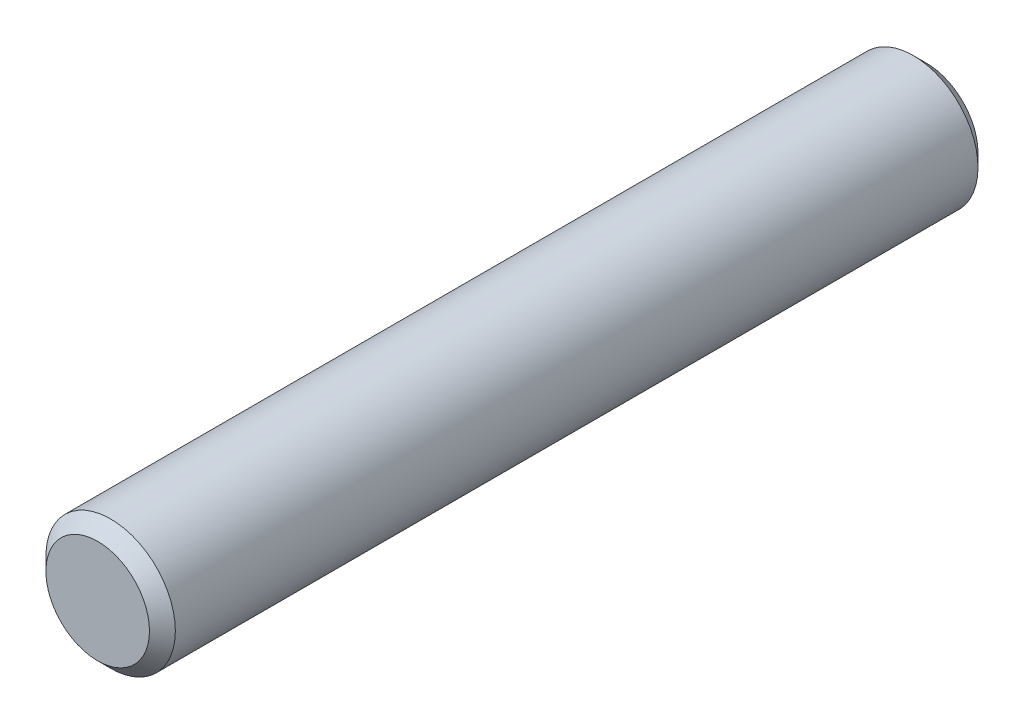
from build123d import *

# Parameters (mm, degrees)
ESQUISSE1_R      = 0.5
EXTRUSION1_DEPTH = 6.4
CHANFREIN1_SIZE  = 0.1


with BuildPart() as part:
    # Esquisse1 → Extrusion1 (new body)
    with BuildSketch(Plane.XY):
        Circle(ESQUISSE1_R)
    extrude(amount=EXTRUSION1_DEPTH)

    # Chanfrein1
    chanfrein1_edges = [part.edges().sort_by_distance(p)[0] for p in [
        (-0.5, 0, 0),
        (-0.5, 0, 6.4),
    ]]
    chamfer(chanfrein1_edges, length=CHANFREIN1_SIZE)


solid = part.part
